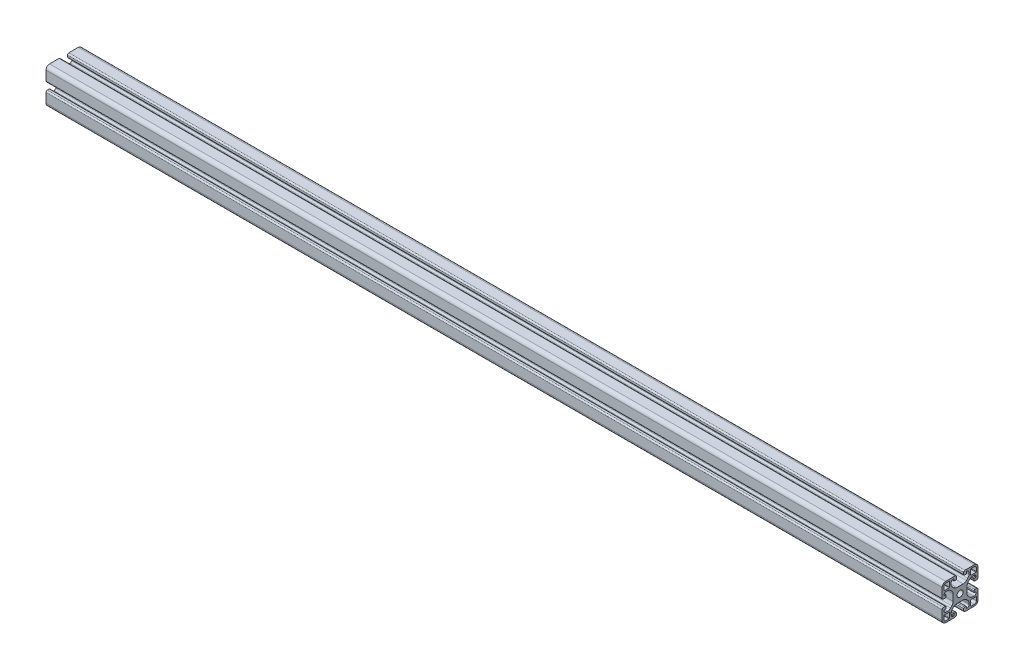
from build123d import *

# Parameters (mm, degrees)
MODEL_R                = 3.4
STRUKTURBAUTEIL1_DEPTH = 1000


with BuildPart() as part:
    # Model → Strukturbauteil1 (new body)
    with BuildSketch(Plane(origin=(0, 0, 0), x_dir=(0, 0, -1), z_dir=(1, 0, 0))):
        with BuildLine():
            Line((-16, -20), (-5.5, -20))
            ThreePointArc((-5.5, -20), (-4.439339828, -19.560660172), (-4, -18.5))
            Line((-4, -18.5), (-4, -16.5))
            ThreePointArc((-4, -16.5), (-4.292893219, -15.792893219), (-5, -15.5))
            Line((-5, -15.5), (-6.5, -15.5))
            ThreePointArc((-6.5, -15.5), (-6.853553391, -15.646446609), (-7, -16))
            Line((-7, -16), (-7, -17.59))
            ThreePointArc((-7, -17.59), (-7.12008622, -17.87991378), (-7.41, -18))
            Line((-7.41, -18), (-7.5, -18))
            ThreePointArc((-7.5, -18), (-9.267766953, -17.267766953), (-10, -15.5))
            Line((-10, -15.5), (-10, -14.192388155))
            ThreePointArc((-10, -14.192388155), (-9.619397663, -12.278970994), (-8.535533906, -10.656854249))
            Line((-8.535533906, -10.656854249), (-7.093145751, -9.214466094))
            ThreePointArc((-7.093145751, -9.214466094), (-5.471029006, -8.130602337), (-3.557611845, -7.75))
            Line((-3.557611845, -7.75), (3.557611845, -7.75))
            ThreePointArc((3.557611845, -7.75), (5.471029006, -8.130602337), (7.093145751, -9.214466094))
            Line((7.093145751, -9.214466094), (8.535533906, -10.656854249))
            ThreePointArc((8.535533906, -10.656854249), (9.619397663, -12.278970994), (10, -14.192388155))
            Line((10, -14.192388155), (10, -15.5))
            ThreePointArc((10, -15.5), (9.267766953, -17.267766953), (7.5, -18))
            Line((7.5, -18), (7.41, -18))
            ThreePointArc((7.41, -18), (7.12008622, -17.87991378), (7, -17.59))
            Line((7, -17.59), (7, -16))
            ThreePointArc((7, -16), (6.853553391, -15.646446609), (6.5, -15.5))
            Line((6.5, -15.5), (5, -15.5))
            ThreePointArc((5, -15.5), (4.292893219, -15.792893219), (4, -16.5))
            Line((4, -16.5), (4, -18.5))
            ThreePointArc((4, -18.5), (4.439339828, -19.560660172), (5.5, -20))
            Line((5.5, -20), (16, -20))
            ThreePointArc((16, -20), (18.828427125, -18.828427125), (20, -16))
            Line((20, -16), (20, -5.5))
            ThreePointArc((20, -5.5), (19.560660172, -4.439339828), (18.5, -4))
            Line((18.5, -4), (16.5, -4))
            ThreePointArc((16.5, -4), (15.792893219, -4.292893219), (15.5, -5))
            Line((15.5, -5), (15.5, -6.5))
            ThreePointArc((15.5, -6.5), (15.646446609, -6.853553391), (16, -7))
            Line((16, -7), (17.59, -7))
            ThreePointArc((17.59, -7), (17.87991378, -7.12008622), (18, -7.41))
            Line((18, -7.41), (18, -7.5))
            ThreePointArc((18, -7.5), (17.267766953, -9.267766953), (15.5, -10))
            Line((15.5, -10), (14.192388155, -10))
            ThreePointArc((14.192388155, -10), (12.278970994, -9.619397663), (10.656854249, -8.535533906))
            Line((10.656854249, -8.535533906), (9.214466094, -7.093145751))
            ThreePointArc((9.214466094, -7.093145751), (8.130602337, -5.471029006), (7.75, -3.557611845))
            Line((7.75, -3.557611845), (7.75, 3.557611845))
            ThreePointArc((7.75, 3.557611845), (8.130602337, 5.471029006), (9.214466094, 7.093145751))
            Line((9.214466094, 7.093145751), (10.656854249, 8.535533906))
            ThreePointArc((10.656854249, 8.535533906), (12.278970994, 9.619397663), (14.192388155, 10))
            Line((14.192388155, 10), (15.5, 10))
            ThreePointArc((15.5, 10), (17.267766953, 9.267766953), (18, 7.5))
            Line((18, 7.5), (18, 7.41))
            ThreePointArc((18, 7.41), (17.87991378, 7.12008622), (17.59, 7))
            Line((17.59, 7), (16, 7))
            ThreePointArc((16, 7), (15.646446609, 6.853553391), (15.5, 6.5))
            Line((15.5, 6.5), (15.5, 5))
            ThreePointArc((15.5, 5), (15.792893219, 4.292893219), (16.5, 4))
            Line((16.5, 4), (18.5, 4))
            ThreePointArc((18.5, 4), (19.560660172, 4.439339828), (20, 5.5))
            Line((20, 5.5), (20, 16))
            ThreePointArc((20, 16), (18.828427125, 18.828427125), (16, 20))
            Line((16, 20), (5.5, 20))
            ThreePointArc((5.5, 20), (4.439339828, 19.560660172), (4, 18.5))
            Line((4, 18.5), (4, 16.5))
            ThreePointArc((4, 16.5), (4.292893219, 15.792893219), (5, 15.5))
            Line((5, 15.5), (6.5, 15.5))
            ThreePointArc((6.5, 15.5), (6.853553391, 15.646446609), (7, 16))
            Line((7, 16), (7, 17.59))
            ThreePointArc((7, 17.59), (7.12008622, 17.87991378), (7.41, 18))
            Line((7.41, 18), (7.5, 18))
            ThreePointArc((7.5, 18), (9.267766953, 17.267766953), (10, 15.5))
            Line((10, 15.5), (10, 14.192388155))
            ThreePointArc((10, 14.192388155), (9.619397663, 12.278970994), (8.535533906, 10.656854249))
            Line((8.535533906, 10.656854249), (7.093145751, 9.214466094))
            ThreePointArc((7.093145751, 9.214466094), (5.471029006, 8.130602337), (3.557611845, 7.75))
            Line((3.557611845, 7.75), (-3.557611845, 7.75))
            ThreePointArc((-3.557611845, 7.75), (-5.471029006, 8.130602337), (-7.093145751, 9.214466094))
            Line((-7.093145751, 9.214466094), (-8.535533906, 10.656854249))
            ThreePointArc((-8.535533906, 10.656854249), (-9.619397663, 12.278970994), (-10, 14.192388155))
            Line((-10, 14.192388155), (-10, 15.5))
            ThreePointArc((-10, 15.5), (-9.267766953, 17.267766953), (-7.5, 18))
            Line((-7.5, 18), (-7.41, 18))
            ThreePointArc((-7.41, 18), (-7.12008622, 17.87991378), (-7, 17.59))
            Line((-7, 17.59), (-7, 16))
            ThreePointArc((-7, 16), (-6.853553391, 15.646446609), (-6.5, 15.5))
            Line((-6.5, 15.5), (-5, 15.5))
            ThreePointArc((-5, 15.5), (-4.292893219, 15.792893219), (-4, 16.5))
            Line((-4, 16.5), (-4, 18.5))
            ThreePointArc((-4, 18.5), (-4.439339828, 19.560660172), (-5.5, 20))
            Line((-5.5, 20), (-16, 20))
            ThreePointArc((-16, 20), (-18.828427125, 18.828427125), (-20, 16))
            Line((-20, 16), (-20, 5.5))
            ThreePointArc((-20, 5.5), (-19.560660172, 4.439339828), (-18.5, 4))
            Line((-18.5, 4), (-16.5, 4))
            ThreePointArc((-16.5, 4), (-15.792893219, 4.292893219), (-15.5, 5))
            Line((-15.5, 5), (-15.5, 6.5))
            ThreePointArc((-15.5, 6.5), (-15.646446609, 6.853553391), (-16, 7))
            Line((-16, 7), (-17.59, 7))
            ThreePointArc((-17.59, 7), (-17.87991378, 7.12008622), (-18, 7.41))
            Line((-18, 7.41), (-18, 7.5))
            ThreePointArc((-18, 7.5), (-17.267766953, 9.267766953), (-15.5, 10))
            Line((-15.5, 10), (-14.192388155, 10))
            ThreePointArc((-14.192388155, 10), (-12.278970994, 9.619397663), (-10.656854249, 8.535533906))
            Line((-10.656854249, 8.535533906), (-9.214466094, 7.093145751))
            ThreePointArc((-9.214466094, 7.093145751), (-8.130602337, 5.471029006), (-7.75, 3.557611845))
            Line((-7.75, 3.557611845), (-7.75, -3.557611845))
            ThreePointArc((-7.75, -3.557611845), (-8.130602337, -5.471029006), (-9.214466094, -7.093145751))
            Line((-9.214466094, -7.093145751), (-10.656854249, -8.535533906))
            ThreePointArc((-10.656854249, -8.535533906), (-12.278970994, -9.619397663), (-14.192388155, -10))
            Line((-14.192388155, -10), (-15.5, -10))
            ThreePointArc((-15.5, -10), (-17.267766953, -9.267766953), (-18, -7.5))
            Line((-18, -7.5), (-18, -7.41))
            ThreePointArc((-18, -7.41), (-17.87991378, -7.12008622), (-17.59, -7))
            Line((-17.59, -7), (-16, -7))
            ThreePointArc((-16, -7), (-15.646446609, -6.853553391), (-15.5, -6.5))
            Line((-15.5, -6.5), (-15.5, -5))
            ThreePointArc((-15.5, -5), (-15.792893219, -4.292893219), (-16.5, -4))
            Line((-16.5, -4), (-18.5, -4))
            ThreePointArc((-18.5, -4), (-19.560660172, -4.439339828), (-20, -5.5))
            Line((-20, -5.5), (-20, -16))
            ThreePointArc((-20, -16), (-18.828427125, -18.828427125), (-16, -20))
        make_face()
        Circle(MODEL_R, mode=Mode.SUBTRACT)
        with BuildLine():
            Line((11.8, 12.3), (11.8, 17.7))
            ThreePointArc((11.8, 17.7), (11.946446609, 18.053553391), (12.3, 18.2))
            Line((12.3, 18.2), (16, 18.2))
            ThreePointArc((16, 18.2), (17.555634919, 17.555634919), (18.2, 16))
            Line((18.2, 16), (18.2, 12.3))
            ThreePointArc((18.2, 12.3), (18.053553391, 11.946446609), (17.7, 11.8))
            Line((17.7, 11.8), (12.3, 11.8))
            ThreePointArc((12.3, 11.8), (11.946446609, 11.946446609), (11.8, 12.3))
        make_face(mode=Mode.SUBTRACT)
        with BuildLine():
            Line((-18.2, 16), (-18.2, 12.3))
            ThreePointArc((-18.2, 12.3), (-18.053553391, 11.946446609), (-17.7, 11.8))
            Line((-17.7, 11.8), (-12.3, 11.8))
            ThreePointArc((-12.3, 11.8), (-11.946446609, 11.946446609), (-11.8, 12.3))
            Line((-11.8, 12.3), (-11.8, 17.7))
            ThreePointArc((-11.8, 17.7), (-11.946446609, 18.053553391), (-12.3, 18.2))
            Line((-12.3, 18.2), (-16, 18.2))
            ThreePointArc((-16, 18.2), (-17.555634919, 17.555634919), (-18.2, 16))
        make_face(mode=Mode.SUBTRACT)
        with BuildLine():
            Line((-18.2, -16), (-18.2, -12.3))
            ThreePointArc((-18.2, -12.3), (-18.053553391, -11.946446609), (-17.7, -11.8))
            Line((-17.7, -11.8), (-12.3, -11.8))
            ThreePointArc((-12.3, -11.8), (-11.946446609, -11.946446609), (-11.8, -12.3))
            Line((-11.8, -12.3), (-11.8, -17.7))
            ThreePointArc((-11.8, -17.7), (-11.946446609, -18.053553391), (-12.3, -18.2))
            Line((-12.3, -18.2), (-16, -18.2))
            ThreePointArc((-16, -18.2), (-17.555634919, -17.555634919), (-18.2, -16))
        make_face(mode=Mode.SUBTRACT)
        with BuildLine():
            Line((12.3, -18.2), (16, -18.2))
            ThreePointArc((16, -18.2), (17.555634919, -17.555634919), (18.2, -16))
            Line((18.2, -16), (18.2, -12.3))
            ThreePointArc((18.2, -12.3), (18.053553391, -11.946446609), (17.7, -11.8))
            Line((17.7, -11.8), (12.3, -11.8))
            ThreePointArc((12.3, -11.8), (11.946446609, -11.946446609), (11.8, -12.3))
            Line((11.8, -12.3), (11.8, -17.7))
            ThreePointArc((11.8, -17.7), (11.946446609, -18.053553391), (12.3, -18.2))
        make_face(mode=Mode.SUBTRACT)
    extrude(amount=STRUKTURBAUTEIL1_DEPTH)


solid = part.part
